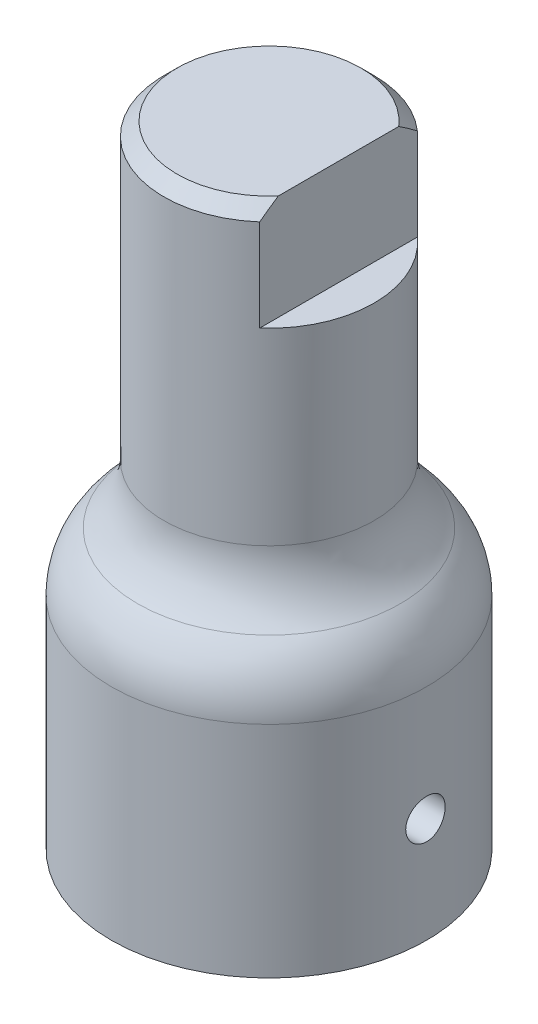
ISO-10303-21;
HEADER;
FILE_DESCRIPTION(('STEP AP214'),'2;1');
FILE_NAME('part.step','',(''),(''),'','','');
FILE_SCHEMA(('AUTOMOTIVE_DESIGN { 1 0 10303 214 1 1 1 1 }'));
ENDSEC;
DATA;
#1=APPLICATION_CONTEXT('core data for automotive mechanical design processes');
#2=APPLICATION_PROTOCOL_DEFINITION('international standard','automotive_design',2000,#1);
#3=PRODUCT_CONTEXT('',#1,'mechanical');
#4=PRODUCT('Part','Part','',(#3));
#5=PRODUCT_RELATED_PRODUCT_CATEGORY('part','',(#4));
#6=PRODUCT_DEFINITION_FORMATION('','',#4);
#7=PRODUCT_DEFINITION_CONTEXT('part definition',#1,'design');
#8=PRODUCT_DEFINITION('design','',#6,#7);
#9=PRODUCT_DEFINITION_SHAPE('','',#8);
#10=(LENGTH_UNIT() NAMED_UNIT(*) SI_UNIT(.MILLI.,.METRE.));
#11=(NAMED_UNIT(*) PLANE_ANGLE_UNIT() SI_UNIT($,.RADIAN.));
#12=(NAMED_UNIT(*) SI_UNIT($,.STERADIAN.) SOLID_ANGLE_UNIT());
#13=UNCERTAINTY_MEASURE_WITH_UNIT(LENGTH_MEASURE(1.E-05),#10,'distance_accuracy_value','');
#14=(GEOMETRIC_REPRESENTATION_CONTEXT(3) GLOBAL_UNCERTAINTY_ASSIGNED_CONTEXT((#13)) GLOBAL_UNIT_ASSIGNED_CONTEXT((#10,
#11,#12)) REPRESENTATION_CONTEXT('',''));
#15=CARTESIAN_POINT('',(0.,0.,0.));
#16=DIRECTION('',(0.,0.,1.));
#17=DIRECTION('',(1.,0.,0.));
#18=AXIS2_PLACEMENT_3D('',#15,#16,#17);
#19=CARTESIAN_POINT('',(0.,15.875,0.));
#20=DIRECTION('',(0.,-1.,0.));
#21=DIRECTION('',(0.,0.,-1.));
#22=AXIS2_PLACEMENT_3D('',#19,#20,#21);
#23=CYLINDRICAL_SURFACE('',#22,9.525);
#24=CARTESIAN_POINT('',(9.45029296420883,6.35,1.190625));
#25=CARTESIAN_POINT('',(9.45029392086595,6.28340296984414,1.19062216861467));
#26=CARTESIAN_POINT('',(9.45100453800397,6.21676431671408,1.18501853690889));
#27=CARTESIAN_POINT('',(9.45376914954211,6.08534157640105,1.16275314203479));
#28=CARTESIAN_POINT('',(9.4558245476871,6.02055950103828,1.14607982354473));
#29=CARTESIAN_POINT('',(9.46104235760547,5.89477173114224,1.10217427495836));
#30=CARTESIAN_POINT('',(9.46420401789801,5.83376350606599,1.07494921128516));
#31=CARTESIAN_POINT('',(9.47127720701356,5.71719307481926,1.01072832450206));
#32=CARTESIAN_POINT('',(9.47518860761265,5.66162993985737,0.973734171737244));
#33=CARTESIAN_POINT('',(9.48334507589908,5.55720460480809,0.890803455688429));
#34=CARTESIAN_POINT('',(9.48759171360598,5.50837728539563,0.844823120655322));
#35=CARTESIAN_POINT('',(9.49592604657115,5.41911090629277,0.745319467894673));
#36=CARTESIAN_POINT('',(9.50001373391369,5.3786722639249,0.691795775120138));
#37=CARTESIAN_POINT('',(9.50758565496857,5.30720605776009,0.578505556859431));
#38=CARTESIAN_POINT('',(9.51106784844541,5.27621005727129,0.51871897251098));
#39=CARTESIAN_POINT('',(9.51701917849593,5.22471116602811,0.39473824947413));
#40=CARTESIAN_POINT('',(9.51948835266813,5.20420788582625,0.330544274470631));
#41=CARTESIAN_POINT('',(9.52312437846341,5.17438065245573,0.199927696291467));
#42=CARTESIAN_POINT('',(9.52429798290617,5.164998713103,0.133518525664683));
#43=CARTESIAN_POINT('',(9.5252336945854,5.15750077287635,5.86743269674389E-05));
#44=CARTESIAN_POINT('',(9.52499585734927,5.1593843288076,-0.0669919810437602));
#45=CARTESIAN_POINT('',(9.52314094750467,5.17431744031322,-0.199436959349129));
#46=CARTESIAN_POINT('',(9.5215315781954,5.18730463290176,-0.264838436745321));
#47=CARTESIAN_POINT('',(9.51712309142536,5.22397887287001,-0.392526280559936));
#48=CARTESIAN_POINT('',(9.51432395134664,5.24766612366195,-0.454812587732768));
#49=CARTESIAN_POINT('',(9.50783717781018,5.30513440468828,-0.574695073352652));
#50=CARTESIAN_POINT('',(9.50414717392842,5.338942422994,-0.632278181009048));
#51=CARTESIAN_POINT('',(9.49629150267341,5.41567292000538,-0.74097711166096));
#52=CARTESIAN_POINT('',(9.49212581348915,5.45859581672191,-0.792092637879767));
#53=CARTESIAN_POINT('',(9.48375135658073,5.55268692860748,-0.886771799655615));
#54=CARTESIAN_POINT('',(9.47954248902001,5.6039094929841,-0.930281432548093));
#55=CARTESIAN_POINT('',(9.47158414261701,5.71295921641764,-1.00809402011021));
#56=CARTESIAN_POINT('',(9.46783466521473,5.77078639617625,-1.04239694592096));
#57=CARTESIAN_POINT('',(9.46121965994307,5.89145197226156,-1.10082547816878));
#58=CARTESIAN_POINT('',(9.45835450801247,5.95429248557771,-1.12494675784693));
#59=CARTESIAN_POINT('',(9.45383987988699,6.08317591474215,-1.16227938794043));
#60=CARTESIAN_POINT('',(9.45219034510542,6.14921867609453,-1.17549126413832));
#61=CARTESIAN_POINT('',(9.45030442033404,6.28215494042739,-1.19055853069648));
#62=CARTESIAN_POINT('',(9.45005857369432,6.34903970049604,-1.19248991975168));
#63=CARTESIAN_POINT('',(9.45098284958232,6.48217934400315,-1.18514191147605));
#64=CARTESIAN_POINT('',(9.45215294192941,6.54843424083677,-1.1758627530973));
#65=CARTESIAN_POINT('',(9.45576862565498,6.67820566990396,-1.14642103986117));
#66=CARTESIAN_POINT('',(9.45820990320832,6.74173068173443,-1.12629528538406));
#67=CARTESIAN_POINT('',(9.46408938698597,6.86450437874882,-1.07576955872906));
#68=CARTESIAN_POINT('',(9.46752762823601,6.92375291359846,-1.04536922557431));
#69=CARTESIAN_POINT('',(9.47503628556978,7.03663564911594,-0.974970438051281));
#70=CARTESIAN_POINT('',(9.47910994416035,7.09023854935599,-0.934922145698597));
#71=CARTESIAN_POINT('',(9.48742025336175,7.18998905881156,-0.846434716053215));
#72=CARTESIAN_POINT('',(9.49165691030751,7.23613637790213,-0.797995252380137));
#73=CARTESIAN_POINT('',(9.49984489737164,7.31993274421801,-0.693768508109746));
#74=CARTESIAN_POINT('',(9.50379446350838,7.35753185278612,-0.637940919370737));
#75=CARTESIAN_POINT('',(9.51093687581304,7.42281895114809,-0.520718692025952));
#76=CARTESIAN_POINT('',(9.51412973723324,7.45050714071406,-0.459324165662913));
#77=CARTESIAN_POINT('',(9.5193911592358,7.49510397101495,-0.332876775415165));
#78=CARTESIAN_POINT('',(9.52146272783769,7.51204147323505,-0.267834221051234));
#79=CARTESIAN_POINT('',(9.5242606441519,7.53475002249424,-0.135800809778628));
#80=CARTESIAN_POINT('',(9.52498705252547,7.54052157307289,-0.0688100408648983));
#81=CARTESIAN_POINT('',(9.52501251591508,7.54072497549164,0.0647305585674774));
#82=CARTESIAN_POINT('',(9.52432126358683,7.5352338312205,0.131280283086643));
#83=CARTESIAN_POINT('',(9.52160834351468,7.51323080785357,0.262503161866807));
#84=CARTESIAN_POINT('',(9.51958667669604,7.4967189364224,0.327176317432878));
#85=CARTESIAN_POINT('',(9.51443908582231,7.45316734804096,0.452800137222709));
#86=CARTESIAN_POINT('',(9.51131354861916,7.4261313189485,0.513752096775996));
#87=CARTESIAN_POINT('',(9.50430430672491,7.36230684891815,0.630266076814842));
#88=CARTESIAN_POINT('',(9.5004205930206,7.32551829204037,0.685828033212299));
#89=CARTESIAN_POINT('',(9.49229683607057,7.24294816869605,0.790378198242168));
#90=CARTESIAN_POINT('',(9.48805462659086,7.19710930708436,0.839320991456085));
#91=CARTESIAN_POINT('',(9.47970938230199,7.09785873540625,0.928849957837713));
#92=CARTESIAN_POINT('',(9.47560638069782,7.04444523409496,0.969434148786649));
#93=CARTESIAN_POINT('',(9.4679872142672,6.93132507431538,1.04122787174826));
#94=CARTESIAN_POINT('',(9.46447337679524,6.87159491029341,1.07240059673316));
#95=CARTESIAN_POINT('',(9.4584576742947,6.74773697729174,1.12422874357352));
#96=CARTESIAN_POINT('',(9.45595470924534,6.68361407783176,1.14489560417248));
#97=CARTESIAN_POINT('',(9.4528518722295,6.57429946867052,1.17017763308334));
#98=CARTESIAN_POINT('',(9.45189706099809,6.52979725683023,1.17783436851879));
#99=CARTESIAN_POINT('',(9.45061728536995,6.44020305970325,1.188058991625));
#100=CARTESIAN_POINT('',(9.45029231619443,6.39511107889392,1.19062691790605));
#101=CARTESIAN_POINT('',(9.45029296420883,6.35,1.190625));
#102=B_SPLINE_CURVE_WITH_KNOTS('',3,(#24,#25,#26,#27,#28,#29,#30,#31,#32,#33,#34,#35,#36,#37,
#38,#39,#40,#41,#42,#43,#44,#45,#46,#47,#48,#49,#50,#51,#52,#53,#54,#55,#56,#57,#58,#59,#60,#61,
#62,#63,#64,#65,#66,#67,#68,#69,#70,#71,#72,#73,#74,#75,#76,#77,#78,#79,#80,#81,#82,#83,#84,#85,
#86,#87,#88,#89,#90,#91,#92,#93,#94,#95,#96,#97,#98,#99,#100,#101),.UNSPECIFIED.,.T.,.F.,(4,2,2,
2,2,2,2,2,2,2,2,2,2,2,2,2,2,2,2,2,2,2,2,2,2,2,2,2,2,2,2,2,2,2,2,2,2,2,4),(0.,0.199626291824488,
0.399461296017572,0.599160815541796,0.798826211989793,0.999489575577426,1.20016291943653,
1.40149986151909,1.60282933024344,1.80310439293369,2.00337157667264,2.2025213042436,
2.4016748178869,2.60136419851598,2.80106273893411,3.00212615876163,3.20319020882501,
3.40433961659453,3.60547932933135,3.80526234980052,4.00504111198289,4.20414629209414,
4.40325846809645,4.60342211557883,4.80359355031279,5.00490594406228,5.20621427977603,
5.40697986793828,5.60773640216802,5.80712492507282,6.00651330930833,6.20583188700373,
6.40515283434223,6.60577861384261,6.80645191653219,7.00790015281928,7.20912858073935,
7.34435121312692,7.4795728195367),.UNSPECIFIED.);
#103=CARTESIAN_POINT('',(9.45029296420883,6.35,1.190625));
#104=VERTEX_POINT('',#103);
#105=EDGE_CURVE('E98',#104,#104,#102,.T.);
#106=ORIENTED_EDGE('',*,*,#105,.F.);
#107=EDGE_LOOP('',(#106));
#108=FACE_BOUND('',#107,.T.);
#109=CARTESIAN_POINT('',(0.,13.2656122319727,0.));
#110=DIRECTION('',(0.,-1.,0.));
#111=DIRECTION('',(0.,0.,-1.));
#112=AXIS2_PLACEMENT_3D('',#109,#110,#111);
#113=CIRCLE('',#112,9.525);
#114=CARTESIAN_POINT('',(0.,13.2656122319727,-9.525));
#115=VERTEX_POINT('',#114);
#116=EDGE_CURVE('E132',#115,#115,#113,.T.);
#117=ORIENTED_EDGE('',*,*,#116,.T.);
#118=EDGE_LOOP('',(#117));
#119=FACE_BOUND('',#118,.T.);
#120=CARTESIAN_POINT('',(0.,0.,0.));
#121=DIRECTION('',(0.,1.,0.));
#122=DIRECTION('',(0.,0.,1.));
#123=AXIS2_PLACEMENT_3D('',#120,#121,#122);
#124=CIRCLE('',#123,9.525);
#125=CARTESIAN_POINT('',(0.,0.,9.525));
#126=VERTEX_POINT('',#125);
#127=EDGE_CURVE('E144',#126,#126,#124,.T.);
#128=ORIENTED_EDGE('',*,*,#127,.T.);
#129=EDGE_LOOP('',(#128));
#130=FACE_BOUND('',#129,.T.);
#131=ADVANCED_FACE('F32',(#108,#119,#130),#23,.T.);
#132=CARTESIAN_POINT('',(0.,0.,0.));
#133=DIRECTION('',(0.,1.,0.));
#134=DIRECTION('',(0.,0.,1.));
#135=AXIS2_PLACEMENT_3D('',#132,#133,#134);
#136=PLANE('',#135);
#137=DIRECTION('',(0.,0.,1.));
#138=VECTOR('',#137,1.);
#139=CARTESIAN_POINT('',(4.95696716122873,0.,-3.96875));
#140=LINE('',#139,#138);
#141=CARTESIAN_POINT('',(4.95696716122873,0.,-3.96875));
#142=VERTEX_POINT('',#141);
#143=CARTESIAN_POINT('',(4.95696716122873,0.,3.96875));
#144=VERTEX_POINT('',#143);
#145=EDGE_CURVE('E153',#142,#144,#140,.T.);
#146=ORIENTED_EDGE('',*,*,#145,.F.);
#147=CARTESIAN_POINT('',(0.,0.,0.));
#148=DIRECTION('',(0.,-1.,0.));
#149=DIRECTION('',(0.,0.,-1.));
#150=AXIS2_PLACEMENT_3D('',#147,#148,#149);
#151=CIRCLE('',#150,6.35);
#152=EDGE_CURVE('E106',#144,#142,#151,.T.);
#153=ORIENTED_EDGE('',*,*,#152,.F.);
#154=EDGE_LOOP('',(#146,#153));
#155=FACE_BOUND('',#154,.T.);
#156=ORIENTED_EDGE('',*,*,#127,.F.);
#157=EDGE_LOOP('',(#156));
#158=FACE_BOUND('',#157,.T.);
#159=ADVANCED_FACE('F169',(#155,#158),#136,.F.);
#160=CARTESIAN_POINT('',(0.,38.1,0.));
#161=DIRECTION('',(0.,-1.,0.));
#162=DIRECTION('',(0.,0.,-1.));
#163=AXIS2_PLACEMENT_3D('',#160,#161,#162);
#164=CYLINDRICAL_SURFACE('',#163,6.35);
#165=DIRECTION('',(0.,1.,0.));
#166=VECTOR('',#165,1.);
#167=CARTESIAN_POINT('',(4.20013020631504,31.75,4.7625));
#168=LINE('',#167,#166);
#169=CARTESIAN_POINT('',(4.20013020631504,31.75,4.7625));
#170=VERTEX_POINT('',#169);
#171=CARTESIAN_POINT('',(4.20013020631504,37.30625,4.7625));
#172=VERTEX_POINT('',#171);
#173=EDGE_CURVE('E87',#170,#172,#168,.T.);
#174=ORIENTED_EDGE('',*,*,#173,.T.);
#175=CARTESIAN_POINT('',(0.,37.30625,0.));
#176=DIRECTION('',(0.,1.,0.));
#177=DIRECTION('',(0.,0.,1.));
#178=AXIS2_PLACEMENT_3D('',#175,#176,#177);
#179=CIRCLE('',#178,6.35);
#180=CARTESIAN_POINT('',(4.20013020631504,37.30625,-4.7625));
#181=VERTEX_POINT('',#180);
#182=EDGE_CURVE('E11',#172,#181,#179,.F.);
#183=ORIENTED_EDGE('',*,*,#182,.T.);
#184=DIRECTION('',(0.,1.,0.));
#185=VECTOR('',#184,1.);
#186=CARTESIAN_POINT('',(4.20013020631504,31.75,-4.7625));
#187=LINE('',#186,#185);
#188=CARTESIAN_POINT('',(4.20013020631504,31.75,-4.7625));
#189=VERTEX_POINT('',#188);
#190=EDGE_CURVE('E85',#189,#181,#187,.T.);
#191=ORIENTED_EDGE('',*,*,#190,.F.);
#192=CARTESIAN_POINT('',(0.,31.75,0.));
#193=DIRECTION('',(0.,1.,0.));
#194=DIRECTION('',(0.,0.,1.));
#195=AXIS2_PLACEMENT_3D('',#192,#193,#194);
#196=CIRCLE('',#195,6.35);
#197=EDGE_CURVE('E78',#170,#189,#196,.T.);
#198=ORIENTED_EDGE('',*,*,#197,.F.);
#199=EDGE_LOOP('',(#174,#183,#191,#198));
#200=FACE_BOUND('',#199,.T.);
#201=CARTESIAN_POINT('',(0.,20.3651280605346,0.));
#202=DIRECTION('',(0.,-1.,0.));
#203=DIRECTION('',(0.,0.,-1.));
#204=AXIS2_PLACEMENT_3D('',#201,#202,#203);
#205=CIRCLE('',#204,6.35);
#206=CARTESIAN_POINT('',(0.,20.3651280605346,-6.35));
#207=VERTEX_POINT('',#206);
#208=EDGE_CURVE('E141',#207,#207,#205,.F.);
#209=ORIENTED_EDGE('',*,*,#208,.T.);
#210=EDGE_LOOP('',(#209));
#211=FACE_BOUND('',#210,.T.);
#212=ADVANCED_FACE('F89',(#200,#211),#164,.T.);
#213=CARTESIAN_POINT('',(0.,38.1,0.));
#214=DIRECTION('',(0.,1.,0.));
#215=DIRECTION('',(0.,0.,1.));
#216=AXIS2_PLACEMENT_3D('',#213,#214,#215);
#217=PLANE('',#216);
#218=DIRECTION('',(0.,0.,1.));
#219=VECTOR('',#218,1.);
#220=CARTESIAN_POINT('',(4.20013020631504,38.1,4.7625));
#221=LINE('',#220,#219);
#222=CARTESIAN_POINT('',(4.20013020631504,38.1,-3.63741945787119));
#223=VERTEX_POINT('',#222);
#224=CARTESIAN_POINT('',(4.20013020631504,38.1,3.6374194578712));
#225=VERTEX_POINT('',#224);
#226=EDGE_CURVE('E82',#223,#225,#221,.T.);
#227=ORIENTED_EDGE('',*,*,#226,.F.);
#228=CARTESIAN_POINT('',(0.,38.1,0.));
#229=DIRECTION('',(0.,1.,0.));
#230=DIRECTION('',(0.,0.,1.));
#231=AXIS2_PLACEMENT_3D('',#228,#229,#230);
#232=CIRCLE('',#231,5.55625);
#233=EDGE_CURVE('E129',#223,#225,#232,.T.);
#234=ORIENTED_EDGE('',*,*,#233,.T.);
#235=EDGE_LOOP('',(#227,#234));
#236=FACE_BOUND('',#235,.T.);
#237=ADVANCED_FACE('F187',(#236),#217,.T.);
#238=CARTESIAN_POINT('',(0.,20.3651280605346,0.));
#239=DIRECTION('',(0.,-1.,0.));
#240=DIRECTION('',(0.,0.,-1.));
#241=AXIS2_PLACEMENT_3D('',#238,#239,#240);
#242=TOROIDAL_SURFACE('',#241,11.1125,4.7625);
#243=CARTESIAN_POINT('',(0.,16.8153701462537,0.));
#244=DIRECTION('',(0.,1.,0.));
#245=DIRECTION('',(0.,0.,1.));
#246=AXIS2_PLACEMENT_3D('',#243,#244,#245);
#247=CIRCLE('',#246,7.93749999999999);
#248=CARTESIAN_POINT('',(0.,16.8153701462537,7.93749999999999));
#249=VERTEX_POINT('',#248);
#250=EDGE_CURVE('E136',#249,#249,#247,.T.);
#251=ORIENTED_EDGE('',*,*,#250,.T.);
#252=EDGE_LOOP('',(#251));
#253=FACE_BOUND('',#252,.T.);
#254=ORIENTED_EDGE('',*,*,#208,.F.);
#255=EDGE_LOOP('',(#254));
#256=FACE_BOUND('',#255,.T.);
#257=ADVANCED_FACE('F184',(#253,#256),#242,.F.);
#258=CARTESIAN_POINT('',(0.,13.2656122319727,0.));
#259=DIRECTION('',(0.,-1.,0.));
#260=DIRECTION('',(0.,0.,-1.));
#261=AXIS2_PLACEMENT_3D('',#258,#259,#260);
#262=DEGENERATE_TOROIDAL_SURFACE('',#261,4.7625,4.7625,.T.);
#263=ORIENTED_EDGE('',*,*,#116,.F.);
#264=EDGE_LOOP('',(#263));
#265=FACE_BOUND('',#264,.T.);
#266=ORIENTED_EDGE('',*,*,#250,.F.);
#267=EDGE_LOOP('',(#266));
#268=FACE_BOUND('',#267,.T.);
#269=ADVANCED_FACE('F186',(#265,#268),#262,.T.);
#270=CARTESIAN_POINT('',(0.,12.7,0.));
#271=DIRECTION('',(0.,-1.,0.));
#272=DIRECTION('',(0.,0.,-1.));
#273=AXIS2_PLACEMENT_3D('',#270,#271,#272);
#274=CYLINDRICAL_SURFACE('',#273,6.35);
#275=ORIENTED_EDGE('',*,*,#152,.T.);
#276=DIRECTION('',(0.,-1.,0.));
#277=VECTOR('',#276,1.);
#278=CARTESIAN_POINT('',(4.95696716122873,12.7,-3.96875));
#279=LINE('',#278,#277);
#280=CARTESIAN_POINT('',(4.95696716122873,12.7,-3.96875));
#281=VERTEX_POINT('',#280);
#282=EDGE_CURVE('E148',#281,#142,#279,.T.);
#283=ORIENTED_EDGE('',*,*,#282,.F.);
#284=CARTESIAN_POINT('',(0.,12.7,0.));
#285=DIRECTION('',(0.,-1.,0.));
#286=DIRECTION('',(0.,0.,-1.));
#287=AXIS2_PLACEMENT_3D('',#284,#285,#286);
#288=CIRCLE('',#287,6.35);
#289=CARTESIAN_POINT('',(4.95696716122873,12.7,3.96875));
#290=VERTEX_POINT('',#289);
#291=EDGE_CURVE('E107',#290,#281,#288,.T.);
#292=ORIENTED_EDGE('',*,*,#291,.F.);
#293=DIRECTION('',(0.,-1.,0.));
#294=VECTOR('',#293,1.);
#295=CARTESIAN_POINT('',(4.95696716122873,12.7,3.96875));
#296=LINE('',#295,#294);
#297=EDGE_CURVE('E147',#290,#144,#296,.T.);
#298=ORIENTED_EDGE('',*,*,#297,.T.);
#299=EDGE_LOOP('',(#275,#283,#292,#298));
#300=FACE_BOUND('',#299,.T.);
#301=ADVANCED_FACE('F167',(#300),#274,.F.);
#302=CARTESIAN_POINT('',(4.95696716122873,12.7,-3.96875));
#303=DIRECTION('',(1.,0.,0.));
#304=DIRECTION('',(0.,0.,-1.));
#305=AXIS2_PLACEMENT_3D('',#302,#303,#304);
#306=PLANE('',#305);
#307=CARTESIAN_POINT('',(4.95696716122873,6.35,0.));
#308=DIRECTION('',(-1.,0.,0.));
#309=DIRECTION('',(0.,0.,1.));
#310=AXIS2_PLACEMENT_3D('',#307,#308,#309);
#311=CIRCLE('',#310,1.190625);
#312=CARTESIAN_POINT('',(4.95696716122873,6.35,1.190625));
#313=VERTEX_POINT('',#312);
#314=EDGE_CURVE('E92',#313,#313,#311,.T.);
#315=ORIENTED_EDGE('',*,*,#314,.F.);
#316=EDGE_LOOP('',(#315));
#317=FACE_BOUND('',#316,.T.);
#318=ORIENTED_EDGE('',*,*,#145,.T.);
#319=ORIENTED_EDGE('',*,*,#297,.F.);
#320=DIRECTION('',(0.,0.,1.));
#321=VECTOR('',#320,1.);
#322=CARTESIAN_POINT('',(4.95696716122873,12.7,-3.96875));
#323=LINE('',#322,#321);
#324=EDGE_CURVE('E151',#281,#290,#323,.T.);
#325=ORIENTED_EDGE('',*,*,#324,.F.);
#326=ORIENTED_EDGE('',*,*,#282,.T.);
#327=EDGE_LOOP('',(#318,#319,#325,#326));
#328=FACE_BOUND('',#327,.T.);
#329=ADVANCED_FACE('F164',(#317,#328),#306,.F.);
#330=CARTESIAN_POINT('',(0.,12.7,0.));
#331=DIRECTION('',(0.,-1.,0.));
#332=DIRECTION('',(0.,0.,-1.));
#333=AXIS2_PLACEMENT_3D('',#330,#331,#332);
#334=PLANE('',#333);
#335=ORIENTED_EDGE('',*,*,#291,.T.);
#336=ORIENTED_EDGE('',*,*,#324,.T.);
#337=EDGE_LOOP('',(#335,#336));
#338=FACE_BOUND('',#337,.T.);
#339=ADVANCED_FACE('F161',(#338),#334,.T.);
#340=CARTESIAN_POINT('',(9.526,6.35,0.));
#341=DIRECTION('',(-1.,0.,0.));
#342=DIRECTION('',(0.,0.,1.));
#343=AXIS2_PLACEMENT_3D('',#340,#341,#342);
#344=CYLINDRICAL_SURFACE('',#343,1.190625);
#345=ORIENTED_EDGE('',*,*,#314,.T.);
#346=EDGE_LOOP('',(#345));
#347=FACE_BOUND('',#346,.T.);
#348=ORIENTED_EDGE('',*,*,#105,.T.);
#349=EDGE_LOOP('',(#348));
#350=FACE_BOUND('',#349,.T.);
#351=ADVANCED_FACE('F109',(#347,#350),#344,.F.);
#352=CARTESIAN_POINT('',(4.20013020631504,31.75,4.7625));
#353=DIRECTION('',(-1.,0.,0.));
#354=DIRECTION('',(0.,0.,1.));
#355=AXIS2_PLACEMENT_3D('',#352,#353,#354);
#356=PLANE('',#355);
#357=ORIENTED_EDGE('',*,*,#226,.T.);
#358=CARTESIAN_POINT('',(4.20013020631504,38.1,3.6374194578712));
#359=CARTESIAN_POINT('',(4.20013020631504,38.037124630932,3.73344800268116));
#360=CARTESIAN_POINT('',(4.20013020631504,37.973270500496,3.82882916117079));
#361=CARTESIAN_POINT('',(4.20013020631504,37.8438662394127,4.01839974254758));
#362=CARTESIAN_POINT('',(4.20013020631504,37.7783165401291,4.11258945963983));
#363=CARTESIAN_POINT('',(4.20013020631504,37.6457540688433,4.29992374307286));
#364=CARTESIAN_POINT('',(4.20013020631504,37.5787413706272,4.39306836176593));
#365=CARTESIAN_POINT('',(4.20013020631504,37.4434185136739,4.57844684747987));
#366=CARTESIAN_POINT('',(4.20013020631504,37.3751080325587,4.67068047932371));
#367=CARTESIAN_POINT('',(4.20013020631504,37.30625,4.7625));
#368=B_SPLINE_CURVE_WITH_KNOTS('',3,(#358,#359,#360,#361,#362,#363,#364,#365,#366,#367),
.UNSPECIFIED.,.F.,.F.,(4,2,2,2,4),(0.,0.344330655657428,0.688574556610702,1.0328011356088,
1.37711437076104),.UNSPECIFIED.);
#369=EDGE_CURVE('E41',#225,#172,#368,.T.);
#370=ORIENTED_EDGE('',*,*,#369,.T.);
#371=ORIENTED_EDGE('',*,*,#173,.F.);
#372=DIRECTION('',(0.,0.,1.));
#373=VECTOR('',#372,1.);
#374=CARTESIAN_POINT('',(4.20013020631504,31.75,4.7625));
#375=LINE('',#374,#373);
#376=EDGE_CURVE('E81',#189,#170,#375,.T.);
#377=ORIENTED_EDGE('',*,*,#376,.F.);
#378=ORIENTED_EDGE('',*,*,#190,.T.);
#379=CARTESIAN_POINT('',(4.20013020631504,37.30625,-4.7625));
#380=CARTESIAN_POINT('',(4.20013020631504,37.3751080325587,-4.67068047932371));
#381=CARTESIAN_POINT('',(4.20013020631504,37.4434185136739,-4.57844684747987));
#382=CARTESIAN_POINT('',(4.20013020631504,37.5787413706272,-4.39306836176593));
#383=CARTESIAN_POINT('',(4.20013020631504,37.6457540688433,-4.29992374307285));
#384=CARTESIAN_POINT('',(4.20013020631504,37.7783165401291,-4.11258945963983));
#385=CARTESIAN_POINT('',(4.20013020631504,37.8438662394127,-4.01839974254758));
#386=CARTESIAN_POINT('',(4.20013020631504,37.973270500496,-3.82882916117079));
#387=CARTESIAN_POINT('',(4.20013020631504,38.037124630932,-3.73344800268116));
#388=CARTESIAN_POINT('',(4.20013020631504,38.1,-3.6374194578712));
#389=B_SPLINE_CURVE_WITH_KNOTS('',3,(#379,#380,#381,#382,#383,#384,#385,#386,#387,#388),
.UNSPECIFIED.,.F.,.F.,(4,2,2,2,4),(0.,0.344313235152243,0.688539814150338,1.03278371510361,
1.37711437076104),.UNSPECIFIED.);
#390=EDGE_CURVE('E119',#181,#223,#389,.T.);
#391=ORIENTED_EDGE('',*,*,#390,.T.);
#392=EDGE_LOOP('',(#357,#370,#371,#377,#378,#391));
#393=FACE_BOUND('',#392,.T.);
#394=ADVANCED_FACE('F84',(#393),#356,.F.);
#395=CARTESIAN_POINT('',(0.,31.75,0.));
#396=DIRECTION('',(0.,1.,0.));
#397=DIRECTION('',(0.,0.,1.));
#398=AXIS2_PLACEMENT_3D('',#395,#396,#397);
#399=PLANE('',#398);
#400=ORIENTED_EDGE('',*,*,#197,.T.);
#401=ORIENTED_EDGE('',*,*,#376,.T.);
#402=EDGE_LOOP('',(#400,#401));
#403=FACE_BOUND('',#402,.T.);
#404=ADVANCED_FACE('F80',(#403),#399,.T.);
#405=CARTESIAN_POINT('',(0.,38.1,0.));
#406=DIRECTION('',(0.,-1.,0.));
#407=DIRECTION('',(0.,0.,-1.));
#408=AXIS2_PLACEMENT_3D('',#405,#406,#407);
#409=CONICAL_SURFACE('',#408,5.55625,0.785398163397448);
#410=ORIENTED_EDGE('',*,*,#390,.F.);
#411=ORIENTED_EDGE('',*,*,#182,.F.);
#412=ORIENTED_EDGE('',*,*,#369,.F.);
#413=ORIENTED_EDGE('',*,*,#233,.F.);
#414=EDGE_LOOP('',(#410,#411,#412,#413));
#415=FACE_BOUND('',#414,.T.);
#416=ADVANCED_FACE('F34',(#415),#409,.T.);
#417=CLOSED_SHELL('',(#131,#159,#212,#237,#257,#269,#301,#329,#339,#351,#394,#404,#416));
#418=MANIFOLD_SOLID_BREP('B2',#417);
#419=ADVANCED_BREP_SHAPE_REPRESENTATION('',(#18,#418),#14);
#420=SHAPE_DEFINITION_REPRESENTATION(#9,#419);
ENDSEC;
END-ISO-10303-21;
